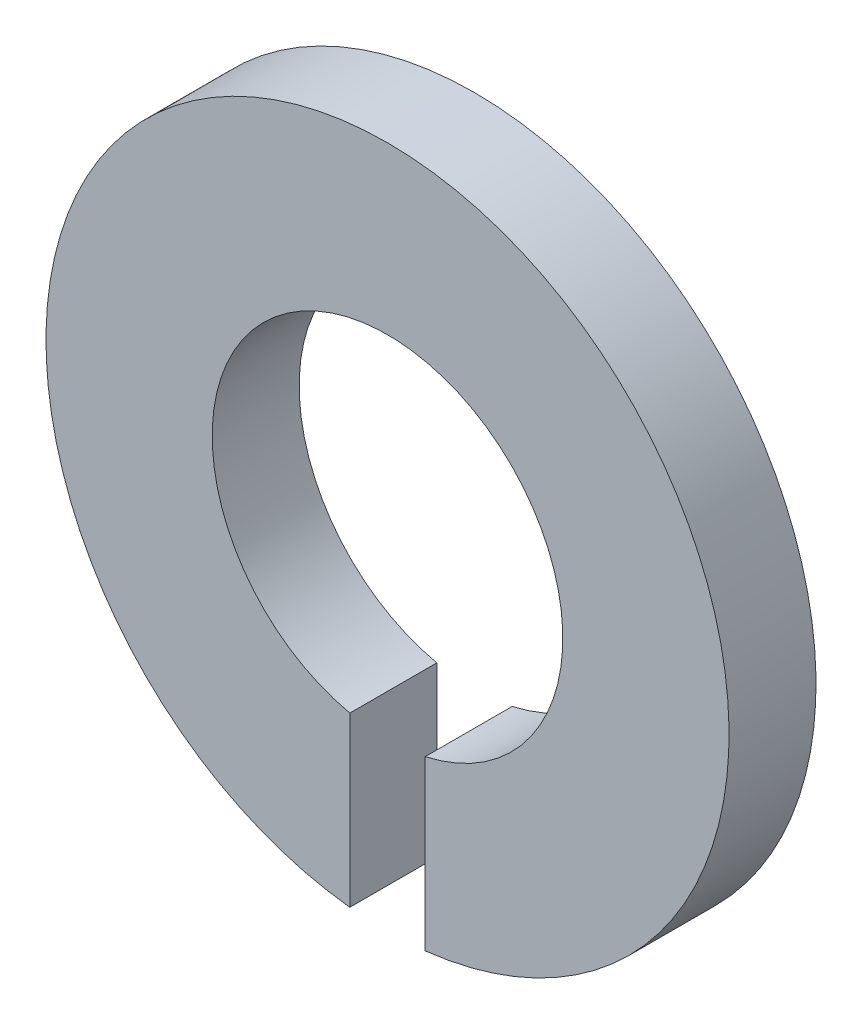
ISO-10303-21;
HEADER;
FILE_DESCRIPTION(('STEP AP214'),'2;1');
FILE_NAME('part.step','',(''),(''),'','','');
FILE_SCHEMA(('AUTOMOTIVE_DESIGN { 1 0 10303 214 1 1 1 1 }'));
ENDSEC;
DATA;
#1=APPLICATION_CONTEXT('core data for automotive mechanical design processes');
#2=APPLICATION_PROTOCOL_DEFINITION('international standard','automotive_design',2000,#1);
#3=PRODUCT_CONTEXT('',#1,'mechanical');
#4=PRODUCT('Part','Part','',(#3));
#5=PRODUCT_RELATED_PRODUCT_CATEGORY('part','',(#4));
#6=PRODUCT_DEFINITION_FORMATION('','',#4);
#7=PRODUCT_DEFINITION_CONTEXT('part definition',#1,'design');
#8=PRODUCT_DEFINITION('design','',#6,#7);
#9=PRODUCT_DEFINITION_SHAPE('','',#8);
#10=(LENGTH_UNIT() NAMED_UNIT(*) SI_UNIT(.MILLI.,.METRE.));
#11=(NAMED_UNIT(*) PLANE_ANGLE_UNIT() SI_UNIT($,.RADIAN.));
#12=(NAMED_UNIT(*) SI_UNIT($,.STERADIAN.) SOLID_ANGLE_UNIT());
#13=UNCERTAINTY_MEASURE_WITH_UNIT(LENGTH_MEASURE(1.E-05),#10,'distance_accuracy_value','');
#14=(GEOMETRIC_REPRESENTATION_CONTEXT(3) GLOBAL_UNCERTAINTY_ASSIGNED_CONTEXT((#13)) GLOBAL_UNIT_ASSIGNED_CONTEXT((#10,
#11,#12)) REPRESENTATION_CONTEXT('',''));
#15=CARTESIAN_POINT('',(0.,0.,0.));
#16=DIRECTION('',(0.,0.,1.));
#17=DIRECTION('',(1.,0.,0.));
#18=AXIS2_PLACEMENT_3D('',#15,#16,#17);
#19=CARTESIAN_POINT('',(0.,0.,1.5748));
#20=DIRECTION('',(0.,0.,-1.));
#21=DIRECTION('',(-1.,0.,0.));
#22=AXIS2_PLACEMENT_3D('',#19,#20,#21);
#23=CYLINDRICAL_SURFACE('',#22,3.175);
#24=CARTESIAN_POINT('',(0.,0.,0.));
#25=DIRECTION('',(0.,0.,-1.));
#26=DIRECTION('',(1.,0.,0.));
#27=AXIS2_PLACEMENT_3D('',#24,#25,#26);
#28=CIRCLE('',#27,3.175);
#29=CARTESIAN_POINT('',(-0.68282677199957,-3.10070517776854,0.));
#30=VERTEX_POINT('',#29);
#31=CARTESIAN_POINT('',(0.68282677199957,-3.10070517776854,0.));
#32=VERTEX_POINT('',#31);
#33=EDGE_CURVE('E72',#30,#32,#28,.T.);
#34=ORIENTED_EDGE('',*,*,#33,.T.);
#35=DIRECTION('',(0.,0.,-1.));
#36=VECTOR('',#35,1.);
#37=CARTESIAN_POINT('',(0.68282677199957,-3.10070517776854,1.5748));
#38=LINE('',#37,#36);
#39=CARTESIAN_POINT('',(0.68282677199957,-3.10070517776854,1.5748));
#40=VERTEX_POINT('',#39);
#41=EDGE_CURVE('E11',#40,#32,#38,.T.);
#42=ORIENTED_EDGE('',*,*,#41,.F.);
#43=CARTESIAN_POINT('',(0.,0.,1.5748));
#44=DIRECTION('',(0.,0.,-1.));
#45=DIRECTION('',(1.,0.,0.));
#46=AXIS2_PLACEMENT_3D('',#43,#44,#45);
#47=CIRCLE('',#46,3.175);
#48=CARTESIAN_POINT('',(-0.68282677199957,-3.10070517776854,1.5748));
#49=VERTEX_POINT('',#48);
#50=EDGE_CURVE('E90',#49,#40,#47,.T.);
#51=ORIENTED_EDGE('',*,*,#50,.F.);
#52=DIRECTION('',(0.,0.,-1.));
#53=VECTOR('',#52,1.);
#54=CARTESIAN_POINT('',(-0.68282677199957,-3.10070517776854,1.5748));
#55=LINE('',#54,#53);
#56=EDGE_CURVE('E84',#49,#30,#55,.T.);
#57=ORIENTED_EDGE('',*,*,#56,.T.);
#58=EDGE_LOOP('',(#34,#42,#51,#57));
#59=FACE_BOUND('',#58,.T.);
#60=ADVANCED_FACE('F28',(#59),#23,.F.);
#61=CARTESIAN_POINT('',(0.68282677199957,-3.10070517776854,1.5748));
#62=DIRECTION('',(1.,0.,0.));
#63=DIRECTION('',(0.,1.,0.));
#64=AXIS2_PLACEMENT_3D('',#61,#62,#63);
#65=PLANE('',#64);
#66=DIRECTION('',(0.,-1.,0.));
#67=VECTOR('',#66,1.);
#68=CARTESIAN_POINT('',(0.68282677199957,-3.10070517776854,0.));
#69=LINE('',#68,#67);
#70=CARTESIAN_POINT('',(0.682826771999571,-6.14709163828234,0.));
#71=VERTEX_POINT('',#70);
#72=EDGE_CURVE('E68',#32,#71,#69,.T.);
#73=ORIENTED_EDGE('',*,*,#72,.T.);
#74=DIRECTION('',(0.,0.,-1.));
#75=VECTOR('',#74,1.);
#76=CARTESIAN_POINT('',(0.682826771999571,-6.14709163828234,1.5748));
#77=LINE('',#76,#75);
#78=CARTESIAN_POINT('',(0.682826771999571,-6.14709163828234,1.5748));
#79=VERTEX_POINT('',#78);
#80=EDGE_CURVE('E35',#79,#71,#77,.T.);
#81=ORIENTED_EDGE('',*,*,#80,.F.);
#82=DIRECTION('',(0.,-1.,0.));
#83=VECTOR('',#82,1.);
#84=CARTESIAN_POINT('',(0.68282677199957,-3.10070517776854,1.5748));
#85=LINE('',#84,#83);
#86=EDGE_CURVE('E80',#40,#79,#85,.T.);
#87=ORIENTED_EDGE('',*,*,#86,.F.);
#88=ORIENTED_EDGE('',*,*,#41,.T.);
#89=EDGE_LOOP('',(#73,#81,#87,#88));
#90=FACE_BOUND('',#89,.T.);
#91=ADVANCED_FACE('F79',(#90),#65,.F.);
#92=CARTESIAN_POINT('',(0.,0.,1.5748));
#93=DIRECTION('',(0.,0.,-1.));
#94=DIRECTION('',(-1.,0.,0.));
#95=AXIS2_PLACEMENT_3D('',#92,#93,#94);
#96=CYLINDRICAL_SURFACE('',#95,6.1849);
#97=CARTESIAN_POINT('',(0.,0.,0.));
#98=DIRECTION('',(0.,0.,1.));
#99=DIRECTION('',(1.,0.,0.));
#100=AXIS2_PLACEMENT_3D('',#97,#98,#99);
#101=CIRCLE('',#100,6.1849);
#102=CARTESIAN_POINT('',(-0.68282677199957,-6.14709163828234,0.));
#103=VERTEX_POINT('',#102);
#104=EDGE_CURVE('E73',#71,#103,#101,.T.);
#105=ORIENTED_EDGE('',*,*,#104,.T.);
#106=DIRECTION('',(0.,0.,-1.));
#107=VECTOR('',#106,1.);
#108=CARTESIAN_POINT('',(-0.68282677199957,-6.14709163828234,1.5748));
#109=LINE('',#108,#107);
#110=CARTESIAN_POINT('',(-0.68282677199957,-6.14709163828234,1.5748));
#111=VERTEX_POINT('',#110);
#112=EDGE_CURVE('E96',#111,#103,#109,.T.);
#113=ORIENTED_EDGE('',*,*,#112,.F.);
#114=CARTESIAN_POINT('',(0.,0.,1.5748));
#115=DIRECTION('',(0.,0.,1.));
#116=DIRECTION('',(1.,0.,0.));
#117=AXIS2_PLACEMENT_3D('',#114,#115,#116);
#118=CIRCLE('',#117,6.1849);
#119=EDGE_CURVE('E47',#79,#111,#118,.T.);
#120=ORIENTED_EDGE('',*,*,#119,.F.);
#121=ORIENTED_EDGE('',*,*,#80,.T.);
#122=EDGE_LOOP('',(#105,#113,#120,#121));
#123=FACE_BOUND('',#122,.T.);
#124=ADVANCED_FACE('F99',(#123),#96,.T.);
#125=CARTESIAN_POINT('',(-0.68282677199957,-3.10070517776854,1.5748));
#126=DIRECTION('',(-1.,0.,0.));
#127=DIRECTION('',(0.,-1.,0.));
#128=AXIS2_PLACEMENT_3D('',#125,#126,#127);
#129=PLANE('',#128);
#130=DIRECTION('',(0.,1.,0.));
#131=VECTOR('',#130,1.);
#132=CARTESIAN_POINT('',(-0.68282677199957,-3.10070517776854,0.));
#133=LINE('',#132,#131);
#134=EDGE_CURVE('E88',#103,#30,#133,.T.);
#135=ORIENTED_EDGE('',*,*,#134,.T.);
#136=ORIENTED_EDGE('',*,*,#56,.F.);
#137=DIRECTION('',(0.,1.,0.));
#138=VECTOR('',#137,1.);
#139=CARTESIAN_POINT('',(-0.68282677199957,-3.10070517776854,1.5748));
#140=LINE('',#139,#138);
#141=EDGE_CURVE('E42',#111,#49,#140,.T.);
#142=ORIENTED_EDGE('',*,*,#141,.F.);
#143=ORIENTED_EDGE('',*,*,#112,.T.);
#144=EDGE_LOOP('',(#135,#136,#142,#143));
#145=FACE_BOUND('',#144,.T.);
#146=ADVANCED_FACE('F101',(#145),#129,.F.);
#147=CARTESIAN_POINT('',(0.,0.,1.5748));
#148=DIRECTION('',(0.,0.,1.));
#149=DIRECTION('',(1.,0.,0.));
#150=AXIS2_PLACEMENT_3D('',#147,#148,#149);
#151=PLANE('',#150);
#152=ORIENTED_EDGE('',*,*,#50,.T.);
#153=ORIENTED_EDGE('',*,*,#86,.T.);
#154=ORIENTED_EDGE('',*,*,#119,.T.);
#155=ORIENTED_EDGE('',*,*,#141,.T.);
#156=EDGE_LOOP('',(#152,#153,#154,#155));
#157=FACE_BOUND('',#156,.T.);
#158=ADVANCED_FACE('F102',(#157),#151,.T.);
#159=CARTESIAN_POINT('',(0.,0.,0.));
#160=DIRECTION('',(0.,0.,1.));
#161=DIRECTION('',(1.,0.,0.));
#162=AXIS2_PLACEMENT_3D('',#159,#160,#161);
#163=PLANE('',#162);
#164=ORIENTED_EDGE('',*,*,#33,.F.);
#165=ORIENTED_EDGE('',*,*,#134,.F.);
#166=ORIENTED_EDGE('',*,*,#104,.F.);
#167=ORIENTED_EDGE('',*,*,#72,.F.);
#168=EDGE_LOOP('',(#164,#165,#166,#167));
#169=FACE_BOUND('',#168,.T.);
#170=ADVANCED_FACE('F69',(#169),#163,.F.);
#171=CLOSED_SHELL('',(#60,#91,#124,#146,#158,#170));
#172=MANIFOLD_SOLID_BREP('B2',#171);
#173=ADVANCED_BREP_SHAPE_REPRESENTATION('',(#18,#172),#14);
#174=SHAPE_DEFINITION_REPRESENTATION(#9,#173);
ENDSEC;
END-ISO-10303-21;
